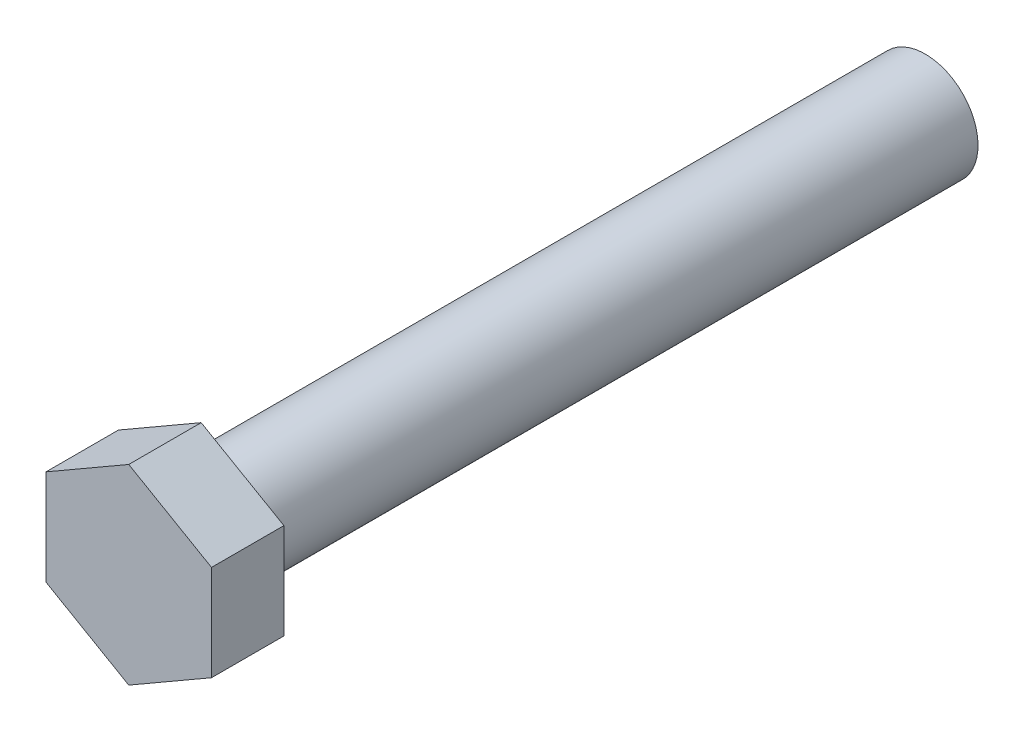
ISO-10303-21;
HEADER;
FILE_DESCRIPTION(('STEP AP214'),'2;1');
FILE_NAME('part.step','',(''),(''),'','','');
FILE_SCHEMA(('AUTOMOTIVE_DESIGN { 1 0 10303 214 1 1 1 1 }'));
ENDSEC;
DATA;
#1=APPLICATION_CONTEXT('core data for automotive mechanical design processes');
#2=APPLICATION_PROTOCOL_DEFINITION('international standard','automotive_design',2000,#1);
#3=PRODUCT_CONTEXT('',#1,'mechanical');
#4=PRODUCT('Part','Part','',(#3));
#5=PRODUCT_RELATED_PRODUCT_CATEGORY('part','',(#4));
#6=PRODUCT_DEFINITION_FORMATION('','',#4);
#7=PRODUCT_DEFINITION_CONTEXT('part definition',#1,'design');
#8=PRODUCT_DEFINITION('design','',#6,#7);
#9=PRODUCT_DEFINITION_SHAPE('','',#8);
#10=(LENGTH_UNIT() NAMED_UNIT(*) SI_UNIT(.MILLI.,.METRE.));
#11=(NAMED_UNIT(*) PLANE_ANGLE_UNIT() SI_UNIT($,.RADIAN.));
#12=(NAMED_UNIT(*) SI_UNIT($,.STERADIAN.) SOLID_ANGLE_UNIT());
#13=UNCERTAINTY_MEASURE_WITH_UNIT(LENGTH_MEASURE(1.E-05),#10,'distance_accuracy_value','');
#14=(GEOMETRIC_REPRESENTATION_CONTEXT(3) GLOBAL_UNCERTAINTY_ASSIGNED_CONTEXT((#13)) GLOBAL_UNIT_ASSIGNED_CONTEXT((#10,
#11,#12)) REPRESENTATION_CONTEXT('',''));
#15=CARTESIAN_POINT('',(0.,0.,0.));
#16=DIRECTION('',(0.,0.,1.));
#17=DIRECTION('',(1.,0.,0.));
#18=AXIS2_PLACEMENT_3D('',#15,#16,#17);
#19=CARTESIAN_POINT('',(4.,4.61880215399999,3.5));
#20=DIRECTION('',(0.,0.,1.));
#21=DIRECTION('',(-1.,0.,0.));
#22=AXIS2_PLACEMENT_3D('',#19,#20,#21);
#23=PLANE('',#22);
#24=DIRECTION('',(0.,-1.,0.));
#25=VECTOR('',#24,1.);
#26=CARTESIAN_POINT('',(4.,0.,3.5));
#27=LINE('',#26,#25);
#28=CARTESIAN_POINT('',(4.,2.309401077,3.5));
#29=VERTEX_POINT('',#28);
#30=CARTESIAN_POINT('',(4.,-2.30940107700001,3.5));
#31=VERTEX_POINT('',#30);
#32=EDGE_CURVE('E94',#29,#31,#27,.T.);
#33=ORIENTED_EDGE('',*,*,#32,.F.);
#34=DIRECTION('',(-0.866025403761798,0.500000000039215,0.));
#35=VECTOR('',#34,1.);
#36=CARTESIAN_POINT('',(2.,3.46410161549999,3.5));
#37=LINE('',#36,#35);
#38=CARTESIAN_POINT('',(-2.23606766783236E-09,4.618802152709,3.5));
#39=VERTEX_POINT('',#38);
#40=EDGE_CURVE('E98',#29,#39,#37,.T.);
#41=ORIENTED_EDGE('',*,*,#40,.T.);
#42=DIRECTION('',(0.866025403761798,0.500000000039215,0.));
#43=VECTOR('',#42,1.);
#44=CARTESIAN_POINT('',(-2.,3.46410161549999,3.5));
#45=LINE('',#44,#43);
#46=CARTESIAN_POINT('',(-4.,2.309401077,3.5));
#47=VERTEX_POINT('',#46);
#48=EDGE_CURVE('E79',#47,#39,#45,.T.);
#49=ORIENTED_EDGE('',*,*,#48,.F.);
#50=DIRECTION('',(0.,-1.,0.));
#51=VECTOR('',#50,1.);
#52=CARTESIAN_POINT('',(-4.,0.,3.5));
#53=LINE('',#52,#51);
#54=CARTESIAN_POINT('',(-4.,-2.30940107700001,3.5));
#55=VERTEX_POINT('',#54);
#56=EDGE_CURVE('E74',#47,#55,#53,.T.);
#57=ORIENTED_EDGE('',*,*,#56,.T.);
#58=DIRECTION('',(0.866025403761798,-0.500000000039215,0.));
#59=VECTOR('',#58,1.);
#60=CARTESIAN_POINT('',(-2.,-3.46410161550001,3.5));
#61=LINE('',#60,#59);
#62=CARTESIAN_POINT('',(-2.23606810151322E-09,-4.618802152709,3.5));
#63=VERTEX_POINT('',#62);
#64=EDGE_CURVE('E76',#55,#63,#61,.T.);
#65=ORIENTED_EDGE('',*,*,#64,.T.);
#66=DIRECTION('',(-0.866025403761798,-0.500000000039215,0.));
#67=VECTOR('',#66,1.);
#68=CARTESIAN_POINT('',(2.,-3.46410161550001,3.5));
#69=LINE('',#68,#67);
#70=EDGE_CURVE('E90',#31,#63,#69,.T.);
#71=ORIENTED_EDGE('',*,*,#70,.F.);
#72=EDGE_LOOP('',(#33,#41,#49,#57,#65,#71));
#73=FACE_BOUND('',#72,.T.);
#74=ADVANCED_FACE('F14',(#73),#23,.T.);
#75=CARTESIAN_POINT('',(-4.,2.309401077,0.));
#76=DIRECTION('',(1.,0.,0.));
#77=DIRECTION('',(0.,0.,1.));
#78=AXIS2_PLACEMENT_3D('',#75,#76,#77);
#79=PLANE('',#78);
#80=ORIENTED_EDGE('',*,*,#56,.F.);
#81=DIRECTION('',(0.,0.,1.));
#82=VECTOR('',#81,1.);
#83=CARTESIAN_POINT('',(-4.,2.309401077,1.75));
#84=LINE('',#83,#82);
#85=CARTESIAN_POINT('',(-4.,2.309401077,0.));
#86=VERTEX_POINT('',#85);
#87=EDGE_CURVE('E54',#86,#47,#84,.T.);
#88=ORIENTED_EDGE('',*,*,#87,.F.);
#89=DIRECTION('',(0.,-1.,0.));
#90=VECTOR('',#89,1.);
#91=CARTESIAN_POINT('',(-4.,0.,0.));
#92=LINE('',#91,#90);
#93=CARTESIAN_POINT('',(-4.,-2.309401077,0.));
#94=VERTEX_POINT('',#93);
#95=EDGE_CURVE('E48',#86,#94,#92,.T.);
#96=ORIENTED_EDGE('',*,*,#95,.T.);
#97=DIRECTION('',(0.,0.,1.));
#98=VECTOR('',#97,1.);
#99=CARTESIAN_POINT('',(-4.,-2.30940107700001,1.75));
#100=LINE('',#99,#98);
#101=EDGE_CURVE('E80',#94,#55,#100,.T.);
#102=ORIENTED_EDGE('',*,*,#101,.T.);
#103=EDGE_LOOP('',(#80,#88,#96,#102));
#104=FACE_BOUND('',#103,.T.);
#105=ADVANCED_FACE('F82',(#104),#79,.F.);
#106=CARTESIAN_POINT('',(0.,-4.618802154,0.));
#107=DIRECTION('',(0.500000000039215,0.866025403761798,0.));
#108=DIRECTION('',(-0.866025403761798,0.500000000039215,0.));
#109=AXIS2_PLACEMENT_3D('',#106,#107,#108);
#110=PLANE('',#109);
#111=ORIENTED_EDGE('',*,*,#64,.F.);
#112=ORIENTED_EDGE('',*,*,#101,.F.);
#113=DIRECTION('',(-0.866025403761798,0.500000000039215,0.));
#114=VECTOR('',#113,1.);
#115=CARTESIAN_POINT('',(0.,-4.618802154,0.));
#116=LINE('',#115,#114);
#117=CARTESIAN_POINT('',(0.,-4.618802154,0.));
#118=VERTEX_POINT('',#117);
#119=EDGE_CURVE('E18',#94,#118,#116,.F.);
#120=ORIENTED_EDGE('',*,*,#119,.T.);
#121=DIRECTION('',(0.,0.,-1.));
#122=VECTOR('',#121,1.);
#123=CARTESIAN_POINT('',(0.,-4.61880215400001,1.75));
#124=LINE('',#123,#122);
#125=EDGE_CURVE('E88',#63,#118,#124,.T.);
#126=ORIENTED_EDGE('',*,*,#125,.F.);
#127=EDGE_LOOP('',(#111,#112,#120,#126));
#128=FACE_BOUND('',#127,.T.);
#129=ADVANCED_FACE('F86',(#128),#110,.F.);
#130=CARTESIAN_POINT('',(0.,-4.618802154,0.));
#131=DIRECTION('',(0.500000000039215,-0.866025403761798,0.));
#132=DIRECTION('',(0.866025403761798,0.500000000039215,0.));
#133=AXIS2_PLACEMENT_3D('',#130,#131,#132);
#134=PLANE('',#133);
#135=ORIENTED_EDGE('',*,*,#125,.T.);
#136=DIRECTION('',(0.866025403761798,0.500000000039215,0.));
#137=VECTOR('',#136,1.);
#138=CARTESIAN_POINT('',(0.,-4.618802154,0.));
#139=LINE('',#138,#137);
#140=CARTESIAN_POINT('',(4.,-2.309401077,0.));
#141=VERTEX_POINT('',#140);
#142=EDGE_CURVE('E105',#118,#141,#139,.T.);
#143=ORIENTED_EDGE('',*,*,#142,.T.);
#144=DIRECTION('',(0.,0.,-1.));
#145=VECTOR('',#144,1.);
#146=CARTESIAN_POINT('',(4.,-2.30940107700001,1.75));
#147=LINE('',#146,#145);
#148=EDGE_CURVE('E97',#31,#141,#147,.T.);
#149=ORIENTED_EDGE('',*,*,#148,.F.);
#150=ORIENTED_EDGE('',*,*,#70,.T.);
#151=EDGE_LOOP('',(#135,#143,#149,#150));
#152=FACE_BOUND('',#151,.T.);
#153=ADVANCED_FACE('F122',(#152),#134,.T.);
#154=CARTESIAN_POINT('',(4.,2.309401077,0.));
#155=DIRECTION('',(1.,0.,0.));
#156=DIRECTION('',(0.,0.,1.));
#157=AXIS2_PLACEMENT_3D('',#154,#155,#156);
#158=PLANE('',#157);
#159=ORIENTED_EDGE('',*,*,#148,.T.);
#160=DIRECTION('',(0.,1.,0.));
#161=VECTOR('',#160,1.);
#162=CARTESIAN_POINT('',(4.,0.,0.));
#163=LINE('',#162,#161);
#164=CARTESIAN_POINT('',(4.,2.309401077,0.));
#165=VERTEX_POINT('',#164);
#166=EDGE_CURVE('E103',#141,#165,#163,.T.);
#167=ORIENTED_EDGE('',*,*,#166,.T.);
#168=DIRECTION('',(0.,0.,1.));
#169=VECTOR('',#168,1.);
#170=CARTESIAN_POINT('',(4.,2.309401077,1.75));
#171=LINE('',#170,#169);
#172=EDGE_CURVE('E100',#165,#29,#171,.T.);
#173=ORIENTED_EDGE('',*,*,#172,.T.);
#174=ORIENTED_EDGE('',*,*,#32,.T.);
#175=EDGE_LOOP('',(#159,#167,#173,#174));
#176=FACE_BOUND('',#175,.T.);
#177=ADVANCED_FACE('F127',(#176),#158,.T.);
#178=CARTESIAN_POINT('',(0.,4.618802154,0.));
#179=DIRECTION('',(-0.500000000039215,-0.866025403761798,0.));
#180=DIRECTION('',(0.866025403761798,-0.500000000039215,0.));
#181=AXIS2_PLACEMENT_3D('',#178,#179,#180);
#182=PLANE('',#181);
#183=ORIENTED_EDGE('',*,*,#172,.F.);
#184=DIRECTION('',(0.866025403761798,-0.500000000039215,0.));
#185=VECTOR('',#184,1.);
#186=CARTESIAN_POINT('',(0.,4.618802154,0.));
#187=LINE('',#186,#185);
#188=CARTESIAN_POINT('',(0.,4.618802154,0.));
#189=VERTEX_POINT('',#188);
#190=EDGE_CURVE('E33',#165,#189,#187,.F.);
#191=ORIENTED_EDGE('',*,*,#190,.T.);
#192=DIRECTION('',(0.,0.,-1.));
#193=VECTOR('',#192,1.);
#194=CARTESIAN_POINT('',(0.,4.61880215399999,1.75));
#195=LINE('',#194,#193);
#196=EDGE_CURVE('E102',#39,#189,#195,.T.);
#197=ORIENTED_EDGE('',*,*,#196,.F.);
#198=ORIENTED_EDGE('',*,*,#40,.F.);
#199=EDGE_LOOP('',(#183,#191,#197,#198));
#200=FACE_BOUND('',#199,.T.);
#201=ADVANCED_FACE('F129',(#200),#182,.F.);
#202=CARTESIAN_POINT('',(0.,4.618802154,0.));
#203=DIRECTION('',(-0.500000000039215,0.866025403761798,0.));
#204=DIRECTION('',(-0.866025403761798,-0.500000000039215,0.));
#205=AXIS2_PLACEMENT_3D('',#202,#203,#204);
#206=PLANE('',#205);
#207=ORIENTED_EDGE('',*,*,#196,.T.);
#208=DIRECTION('',(-0.866025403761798,-0.500000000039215,0.));
#209=VECTOR('',#208,1.);
#210=CARTESIAN_POINT('',(0.,4.618802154,0.));
#211=LINE('',#210,#209);
#212=EDGE_CURVE('E116',#189,#86,#211,.T.);
#213=ORIENTED_EDGE('',*,*,#212,.T.);
#214=ORIENTED_EDGE('',*,*,#87,.T.);
#215=ORIENTED_EDGE('',*,*,#48,.T.);
#216=EDGE_LOOP('',(#207,#213,#214,#215));
#217=FACE_BOUND('',#216,.T.);
#218=ADVANCED_FACE('F131',(#217),#206,.T.);
#219=CARTESIAN_POINT('',(4.,4.674227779,0.));
#220=DIRECTION('',(0.,0.,1.));
#221=DIRECTION('',(-1.,0.,0.));
#222=AXIS2_PLACEMENT_3D('',#219,#220,#221);
#223=PLANE('',#222);
#224=CARTESIAN_POINT('',(0.,0.,0.));
#225=DIRECTION('',(0.,0.,1.));
#226=DIRECTION('',(0.,-1.,0.));
#227=AXIS2_PLACEMENT_3D('',#224,#225,#226);
#228=CIRCLE('',#227,2.55);
#229=CARTESIAN_POINT('',(0.,-2.55,0.));
#230=VERTEX_POINT('',#229);
#231=EDGE_CURVE('E24',#230,#230,#228,.T.);
#232=ORIENTED_EDGE('',*,*,#231,.T.);
#233=EDGE_LOOP('',(#232));
#234=FACE_BOUND('',#233,.T.);
#235=ORIENTED_EDGE('',*,*,#190,.F.);
#236=ORIENTED_EDGE('',*,*,#166,.F.);
#237=ORIENTED_EDGE('',*,*,#142,.F.);
#238=ORIENTED_EDGE('',*,*,#119,.F.);
#239=ORIENTED_EDGE('',*,*,#95,.F.);
#240=ORIENTED_EDGE('',*,*,#212,.F.);
#241=EDGE_LOOP('',(#235,#236,#237,#238,#239,#240));
#242=FACE_BOUND('',#241,.T.);
#243=ADVANCED_FACE('F124',(#234,#242),#223,.F.);
#244=CARTESIAN_POINT('',(-2.5806,2.58060000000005,-35.));
#245=DIRECTION('',(0.,0.,-1.));
#246=DIRECTION('',(1.,0.,0.));
#247=AXIS2_PLACEMENT_3D('',#244,#245,#246);
#248=PLANE('',#247);
#249=CARTESIAN_POINT('',(0.,0.,-35.));
#250=DIRECTION('',(0.,0.,1.));
#251=DIRECTION('',(0.,-1.,0.));
#252=AXIS2_PLACEMENT_3D('',#249,#250,#251);
#253=CIRCLE('',#252,2.55);
#254=CARTESIAN_POINT('',(0.,-2.54999999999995,-35.));
#255=VERTEX_POINT('',#254);
#256=EDGE_CURVE('E9',#255,#255,#253,.F.);
#257=ORIENTED_EDGE('',*,*,#256,.T.);
#258=EDGE_LOOP('',(#257));
#259=FACE_BOUND('',#258,.T.);
#260=ADVANCED_FACE('F16',(#259),#248,.T.);
#261=CARTESIAN_POINT('',(0.,0.,-35.));
#262=DIRECTION('',(0.,0.,1.));
#263=DIRECTION('',(0.,-1.,0.));
#264=AXIS2_PLACEMENT_3D('',#261,#262,#263);
#265=CYLINDRICAL_SURFACE('',#264,2.55);
#266=ORIENTED_EDGE('',*,*,#231,.F.);
#267=EDGE_LOOP('',(#266));
#268=FACE_BOUND('',#267,.T.);
#269=ORIENTED_EDGE('',*,*,#256,.F.);
#270=EDGE_LOOP('',(#269));
#271=FACE_BOUND('',#270,.T.);
#272=ADVANCED_FACE('F142',(#268,#271),#265,.T.);
#273=CLOSED_SHELL('',(#74,#105,#129,#153,#177,#201,#218,#243,#260,#272));
#274=MANIFOLD_SOLID_BREP('B1',#273);
#275=ADVANCED_BREP_SHAPE_REPRESENTATION('',(#18,#274),#14);
#276=SHAPE_DEFINITION_REPRESENTATION(#9,#275);
ENDSEC;
END-ISO-10303-21;
